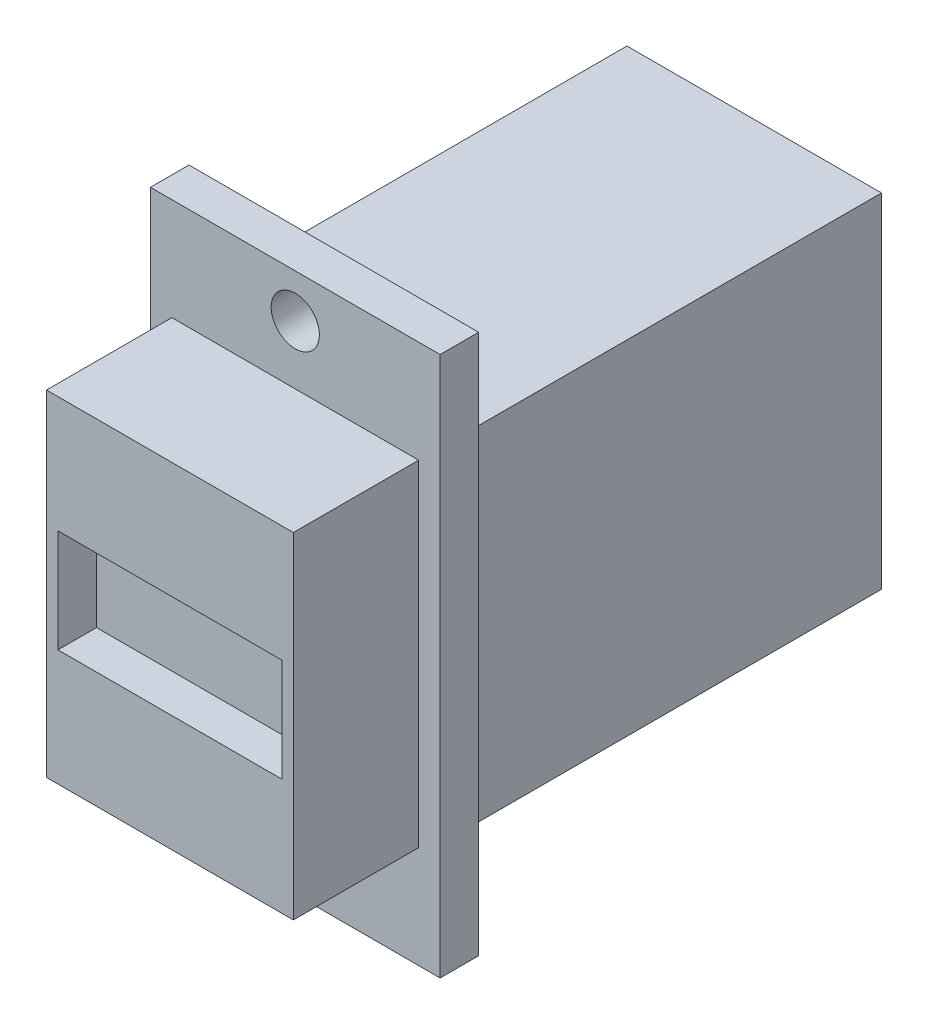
ISO-10303-21;
HEADER;
FILE_DESCRIPTION(('STEP AP214'),'2;1');
FILE_NAME('part.step','',(''),(''),'','','');
FILE_SCHEMA(('AUTOMOTIVE_DESIGN { 1 0 10303 214 1 1 1 1 }'));
ENDSEC;
DATA;
#1=APPLICATION_CONTEXT('core data for automotive mechanical design processes');
#2=APPLICATION_PROTOCOL_DEFINITION('international standard','automotive_design',2000,#1);
#3=PRODUCT_CONTEXT('',#1,'mechanical');
#4=PRODUCT('Part','Part','',(#3));
#5=PRODUCT_RELATED_PRODUCT_CATEGORY('part','',(#4));
#6=PRODUCT_DEFINITION_FORMATION('','',#4);
#7=PRODUCT_DEFINITION_CONTEXT('part definition',#1,'design');
#8=PRODUCT_DEFINITION('design','',#6,#7);
#9=PRODUCT_DEFINITION_SHAPE('','',#8);
#10=(LENGTH_UNIT() NAMED_UNIT(*) SI_UNIT(.MILLI.,.METRE.));
#11=(NAMED_UNIT(*) PLANE_ANGLE_UNIT() SI_UNIT($,.RADIAN.));
#12=(NAMED_UNIT(*) SI_UNIT($,.STERADIAN.) SOLID_ANGLE_UNIT());
#13=UNCERTAINTY_MEASURE_WITH_UNIT(LENGTH_MEASURE(1.E-05),#10,'distance_accuracy_value','');
#14=(GEOMETRIC_REPRESENTATION_CONTEXT(3) GLOBAL_UNCERTAINTY_ASSIGNED_CONTEXT((#13)) GLOBAL_UNIT_ASSIGNED_CONTEXT((#10,
#11,#12)) REPRESENTATION_CONTEXT('',''));
#15=CARTESIAN_POINT('',(0.,0.,0.));
#16=DIRECTION('',(0.,0.,1.));
#17=DIRECTION('',(1.,0.,0.));
#18=AXIS2_PLACEMENT_3D('',#15,#16,#17);
#19=CARTESIAN_POINT('',(0.,0.,0.));
#20=DIRECTION('',(0.,0.,1.));
#21=DIRECTION('',(1.,0.,0.));
#22=AXIS2_PLACEMENT_3D('',#19,#20,#21);
#23=PLANE('',#22);
#24=CARTESIAN_POINT('',(0.,-14.605,0.));
#25=DIRECTION('',(0.,0.,1.));
#26=DIRECTION('',(1.,0.,0.));
#27=AXIS2_PLACEMENT_3D('',#24,#25,#26);
#28=CIRCLE('',#27,1.5875);
#29=CARTESIAN_POINT('',(1.5875,-14.605,0.));
#30=VERTEX_POINT('',#29);
#31=EDGE_CURVE('E286',#30,#30,#28,.T.);
#32=ORIENTED_EDGE('',*,*,#31,.T.);
#33=EDGE_LOOP('',(#32));
#34=FACE_BOUND('',#33,.T.);
#35=CARTESIAN_POINT('',(0.,14.9225,0.));
#36=DIRECTION('',(0.,0.,1.));
#37=DIRECTION('',(1.,0.,0.));
#38=AXIS2_PLACEMENT_3D('',#35,#36,#37);
#39=CIRCLE('',#38,1.5875);
#40=CARTESIAN_POINT('',(1.5875,14.9225,0.));
#41=VERTEX_POINT('',#40);
#42=EDGE_CURVE('E290',#41,#41,#39,.T.);
#43=ORIENTED_EDGE('',*,*,#42,.T.);
#44=EDGE_LOOP('',(#43));
#45=FACE_BOUND('',#44,.T.);
#46=DIRECTION('',(1.,0.,0.));
#47=VECTOR('',#46,1.);
#48=CARTESIAN_POINT('',(-9.53982109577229,17.78,0.));
#49=LINE('',#48,#47);
#50=CARTESIAN_POINT('',(-9.53982109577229,17.78,0.));
#51=VERTEX_POINT('',#50);
#52=CARTESIAN_POINT('',(9.5398210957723,17.78,0.));
#53=VERTEX_POINT('',#52);
#54=EDGE_CURVE('E296',#51,#53,#49,.T.);
#55=ORIENTED_EDGE('',*,*,#54,.T.);
#56=DIRECTION('',(0.,1.,0.));
#57=VECTOR('',#56,1.);
#58=CARTESIAN_POINT('',(9.5398210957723,-17.78,0.));
#59=LINE('',#58,#57);
#60=CARTESIAN_POINT('',(9.5398210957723,-17.78,0.));
#61=VERTEX_POINT('',#60);
#62=EDGE_CURVE('E312',#61,#53,#59,.T.);
#63=ORIENTED_EDGE('',*,*,#62,.F.);
#64=DIRECTION('',(1.,0.,0.));
#65=VECTOR('',#64,1.);
#66=CARTESIAN_POINT('',(-9.53982109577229,-17.78,0.));
#67=LINE('',#66,#65);
#68=CARTESIAN_POINT('',(-9.53982109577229,-17.78,0.));
#69=VERTEX_POINT('',#68);
#70=EDGE_CURVE('E315',#69,#61,#67,.T.);
#71=ORIENTED_EDGE('',*,*,#70,.F.);
#72=DIRECTION('',(0.,1.,0.));
#73=VECTOR('',#72,1.);
#74=CARTESIAN_POINT('',(-9.53982109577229,-17.78,0.));
#75=LINE('',#74,#73);
#76=EDGE_CURVE('E303',#69,#51,#75,.T.);
#77=ORIENTED_EDGE('',*,*,#76,.T.);
#78=EDGE_LOOP('',(#55,#63,#71,#77));
#79=FACE_BOUND('',#78,.T.);
#80=DIRECTION('',(0.,1.,0.));
#81=VECTOR('',#80,1.);
#82=CARTESIAN_POINT('',(-8.382,-11.303,0.));
#83=LINE('',#82,#81);
#84=CARTESIAN_POINT('',(-8.382,-11.303,0.));
#85=VERTEX_POINT('',#84);
#86=CARTESIAN_POINT('',(-8.382,11.303,0.));
#87=VERTEX_POINT('',#86);
#88=EDGE_CURVE('E224',#85,#87,#83,.T.);
#89=ORIENTED_EDGE('',*,*,#88,.F.);
#90=DIRECTION('',(-1.,0.,0.));
#91=VECTOR('',#90,1.);
#92=CARTESIAN_POINT('',(8.382,-11.303,0.));
#93=LINE('',#92,#91);
#94=CARTESIAN_POINT('',(8.382,-11.303,0.));
#95=VERTEX_POINT('',#94);
#96=EDGE_CURVE('E232',#95,#85,#93,.T.);
#97=ORIENTED_EDGE('',*,*,#96,.F.);
#98=DIRECTION('',(0.,-1.,0.));
#99=VECTOR('',#98,1.);
#100=CARTESIAN_POINT('',(8.382,-11.303,0.));
#101=LINE('',#100,#99);
#102=CARTESIAN_POINT('',(8.382,11.303,0.));
#103=VERTEX_POINT('',#102);
#104=EDGE_CURVE('E242',#103,#95,#101,.T.);
#105=ORIENTED_EDGE('',*,*,#104,.F.);
#106=DIRECTION('',(1.,0.,0.));
#107=VECTOR('',#106,1.);
#108=CARTESIAN_POINT('',(8.382,11.303,0.));
#109=LINE('',#108,#107);
#110=EDGE_CURVE('E100',#87,#103,#109,.T.);
#111=ORIENTED_EDGE('',*,*,#110,.F.);
#112=EDGE_LOOP('',(#89,#97,#105,#111));
#113=FACE_BOUND('',#112,.T.);
#114=ADVANCED_FACE('F75',(#34,#45,#79,#113),#23,.F.);
#115=CARTESIAN_POINT('',(0.,0.,2.54));
#116=DIRECTION('',(0.,0.,1.));
#117=DIRECTION('',(1.,0.,0.));
#118=AXIS2_PLACEMENT_3D('',#115,#116,#117);
#119=PLANE('',#118);
#120=CARTESIAN_POINT('',(0.,14.9225,2.54));
#121=DIRECTION('',(0.,0.,1.));
#122=DIRECTION('',(1.,0.,0.));
#123=AXIS2_PLACEMENT_3D('',#120,#121,#122);
#124=CIRCLE('',#123,1.5875);
#125=CARTESIAN_POINT('',(1.5875,14.9225,2.54));
#126=VERTEX_POINT('',#125);
#127=EDGE_CURVE('E293',#126,#126,#124,.T.);
#128=ORIENTED_EDGE('',*,*,#127,.F.);
#129=EDGE_LOOP('',(#128));
#130=FACE_BOUND('',#129,.T.);
#131=DIRECTION('',(1.,0.,0.));
#132=VECTOR('',#131,1.);
#133=CARTESIAN_POINT('',(-9.53982109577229,17.78,2.54));
#134=LINE('',#133,#132);
#135=CARTESIAN_POINT('',(-9.53982109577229,17.78,2.54));
#136=VERTEX_POINT('',#135);
#137=CARTESIAN_POINT('',(9.5398210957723,17.78,2.54));
#138=VERTEX_POINT('',#137);
#139=EDGE_CURVE('E299',#136,#138,#134,.T.);
#140=ORIENTED_EDGE('',*,*,#139,.F.);
#141=DIRECTION('',(0.,1.,0.));
#142=VECTOR('',#141,1.);
#143=CARTESIAN_POINT('',(-9.53982109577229,-17.78,2.54));
#144=LINE('',#143,#142);
#145=CARTESIAN_POINT('',(-9.53982109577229,-17.78,2.54));
#146=VERTEX_POINT('',#145);
#147=EDGE_CURVE('E307',#146,#136,#144,.T.);
#148=ORIENTED_EDGE('',*,*,#147,.F.);
#149=DIRECTION('',(1.,0.,0.));
#150=VECTOR('',#149,1.);
#151=CARTESIAN_POINT('',(-9.53982109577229,-17.78,2.54));
#152=LINE('',#151,#150);
#153=CARTESIAN_POINT('',(9.5398210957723,-17.78,2.54));
#154=VERTEX_POINT('',#153);
#155=EDGE_CURVE('E305',#146,#154,#152,.T.);
#156=ORIENTED_EDGE('',*,*,#155,.T.);
#157=DIRECTION('',(0.,1.,0.));
#158=VECTOR('',#157,1.);
#159=CARTESIAN_POINT('',(9.5398210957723,-17.78,2.54));
#160=LINE('',#159,#158);
#161=EDGE_CURVE('E302',#154,#138,#160,.T.);
#162=ORIENTED_EDGE('',*,*,#161,.T.);
#163=EDGE_LOOP('',(#140,#148,#156,#162));
#164=FACE_BOUND('',#163,.T.);
#165=CARTESIAN_POINT('',(0.,-14.605,2.54));
#166=DIRECTION('',(0.,0.,1.));
#167=DIRECTION('',(1.,0.,0.));
#168=AXIS2_PLACEMENT_3D('',#165,#166,#167);
#169=CIRCLE('',#168,1.5875);
#170=CARTESIAN_POINT('',(1.5875,-14.605,2.54));
#171=VERTEX_POINT('',#170);
#172=EDGE_CURVE('E287',#171,#171,#169,.T.);
#173=ORIENTED_EDGE('',*,*,#172,.F.);
#174=EDGE_LOOP('',(#173));
#175=FACE_BOUND('',#174,.T.);
#176=DIRECTION('',(-1.,0.,0.));
#177=VECTOR('',#176,1.);
#178=CARTESIAN_POINT('',(-8.128,11.049,2.54));
#179=LINE('',#178,#177);
#180=CARTESIAN_POINT('',(8.128,11.049,2.54));
#181=VERTEX_POINT('',#180);
#182=CARTESIAN_POINT('',(-8.128,11.049,2.54));
#183=VERTEX_POINT('',#182);
#184=EDGE_CURVE('E271',#181,#183,#179,.T.);
#185=ORIENTED_EDGE('',*,*,#184,.F.);
#186=DIRECTION('',(0.,1.,0.));
#187=VECTOR('',#186,1.);
#188=CARTESIAN_POINT('',(8.128,-11.049,2.54));
#189=LINE('',#188,#187);
#190=CARTESIAN_POINT('',(8.128,-11.049,2.54));
#191=VERTEX_POINT('',#190);
#192=EDGE_CURVE('E257',#191,#181,#189,.T.);
#193=ORIENTED_EDGE('',*,*,#192,.F.);
#194=DIRECTION('',(1.,0.,0.));
#195=VECTOR('',#194,1.);
#196=CARTESIAN_POINT('',(-8.128,-11.049,2.54));
#197=LINE('',#196,#195);
#198=CARTESIAN_POINT('',(-8.128,-11.049,2.54));
#199=VERTEX_POINT('',#198);
#200=EDGE_CURVE('E262',#199,#191,#197,.T.);
#201=ORIENTED_EDGE('',*,*,#200,.F.);
#202=DIRECTION('',(0.,-1.,0.));
#203=VECTOR('',#202,1.);
#204=CARTESIAN_POINT('',(-8.128,-11.049,2.54));
#205=LINE('',#204,#203);
#206=EDGE_CURVE('E273',#183,#199,#205,.T.);
#207=ORIENTED_EDGE('',*,*,#206,.F.);
#208=EDGE_LOOP('',(#185,#193,#201,#207));
#209=FACE_BOUND('',#208,.T.);
#210=ADVANCED_FACE('F338',(#130,#164,#175,#209),#119,.T.);
#211=CARTESIAN_POINT('',(-9.53982109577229,17.78,2.54));
#212=DIRECTION('',(0.,1.,0.));
#213=DIRECTION('',(0.,0.,1.));
#214=AXIS2_PLACEMENT_3D('',#211,#212,#213);
#215=PLANE('',#214);
#216=ORIENTED_EDGE('',*,*,#54,.F.);
#217=DIRECTION('',(0.,0.,-1.));
#218=VECTOR('',#217,1.);
#219=CARTESIAN_POINT('',(-9.53982109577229,17.78,2.54));
#220=LINE('',#219,#218);
#221=EDGE_CURVE('E12',#136,#51,#220,.T.);
#222=ORIENTED_EDGE('',*,*,#221,.F.);
#223=ORIENTED_EDGE('',*,*,#139,.T.);
#224=DIRECTION('',(0.,0.,-1.));
#225=VECTOR('',#224,1.);
#226=CARTESIAN_POINT('',(9.5398210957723,17.78,2.54));
#227=LINE('',#226,#225);
#228=EDGE_CURVE('E79',#138,#53,#227,.T.);
#229=ORIENTED_EDGE('',*,*,#228,.T.);
#230=EDGE_LOOP('',(#216,#222,#223,#229));
#231=FACE_BOUND('',#230,.T.);
#232=ADVANCED_FACE('F77',(#231),#215,.T.);
#233=CARTESIAN_POINT('',(-9.53982109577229,-17.78,2.54));
#234=DIRECTION('',(-1.,0.,0.));
#235=DIRECTION('',(0.,0.,1.));
#236=AXIS2_PLACEMENT_3D('',#233,#234,#235);
#237=PLANE('',#236);
#238=ORIENTED_EDGE('',*,*,#76,.F.);
#239=DIRECTION('',(0.,0.,-1.));
#240=VECTOR('',#239,1.);
#241=CARTESIAN_POINT('',(-9.53982109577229,-17.78,2.54));
#242=LINE('',#241,#240);
#243=EDGE_CURVE('E84',#146,#69,#242,.T.);
#244=ORIENTED_EDGE('',*,*,#243,.F.);
#245=ORIENTED_EDGE('',*,*,#147,.T.);
#246=ORIENTED_EDGE('',*,*,#221,.T.);
#247=EDGE_LOOP('',(#238,#244,#245,#246));
#248=FACE_BOUND('',#247,.T.);
#249=ADVANCED_FACE('F334',(#248),#237,.T.);
#250=CARTESIAN_POINT('',(-9.53982109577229,-17.78,2.54));
#251=DIRECTION('',(0.,1.,0.));
#252=DIRECTION('',(0.,0.,1.));
#253=AXIS2_PLACEMENT_3D('',#250,#251,#252);
#254=PLANE('',#253);
#255=ORIENTED_EDGE('',*,*,#70,.T.);
#256=DIRECTION('',(0.,0.,-1.));
#257=VECTOR('',#256,1.);
#258=CARTESIAN_POINT('',(9.5398210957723,-17.78,2.54));
#259=LINE('',#258,#257);
#260=EDGE_CURVE('E319',#154,#61,#259,.T.);
#261=ORIENTED_EDGE('',*,*,#260,.F.);
#262=ORIENTED_EDGE('',*,*,#155,.F.);
#263=ORIENTED_EDGE('',*,*,#243,.T.);
#264=EDGE_LOOP('',(#255,#261,#262,#263));
#265=FACE_BOUND('',#264,.T.);
#266=ADVANCED_FACE('F341',(#265),#254,.F.);
#267=CARTESIAN_POINT('',(9.5398210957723,-17.78,2.54));
#268=DIRECTION('',(-1.,0.,0.));
#269=DIRECTION('',(0.,0.,1.));
#270=AXIS2_PLACEMENT_3D('',#267,#268,#269);
#271=PLANE('',#270);
#272=ORIENTED_EDGE('',*,*,#62,.T.);
#273=ORIENTED_EDGE('',*,*,#228,.F.);
#274=ORIENTED_EDGE('',*,*,#161,.F.);
#275=ORIENTED_EDGE('',*,*,#260,.T.);
#276=EDGE_LOOP('',(#272,#273,#274,#275));
#277=FACE_BOUND('',#276,.T.);
#278=ADVANCED_FACE('F329',(#277),#271,.F.);
#279=CARTESIAN_POINT('',(0.,14.9225,2.54));
#280=DIRECTION('',(0.,0.,-1.));
#281=DIRECTION('',(-1.,0.,0.));
#282=AXIS2_PLACEMENT_3D('',#279,#280,#281);
#283=CYLINDRICAL_SURFACE('',#282,1.5875);
#284=ORIENTED_EDGE('',*,*,#127,.T.);
#285=EDGE_LOOP('',(#284));
#286=FACE_BOUND('',#285,.T.);
#287=ORIENTED_EDGE('',*,*,#42,.F.);
#288=EDGE_LOOP('',(#287));
#289=FACE_BOUND('',#288,.T.);
#290=ADVANCED_FACE('F348',(#286,#289),#283,.F.);
#291=CARTESIAN_POINT('',(0.,-14.605,2.54));
#292=DIRECTION('',(0.,0.,-1.));
#293=DIRECTION('',(-1.,0.,0.));
#294=AXIS2_PLACEMENT_3D('',#291,#292,#293);
#295=CYLINDRICAL_SURFACE('',#294,1.5875);
#296=ORIENTED_EDGE('',*,*,#172,.T.);
#297=EDGE_LOOP('',(#296));
#298=FACE_BOUND('',#297,.T.);
#299=ORIENTED_EDGE('',*,*,#31,.F.);
#300=EDGE_LOOP('',(#299));
#301=FACE_BOUND('',#300,.T.);
#302=ADVANCED_FACE('F364',(#298,#301),#295,.F.);
#303=CARTESIAN_POINT('',(8.128,-11.049,10.795));
#304=DIRECTION('',(-1.,0.,0.));
#305=DIRECTION('',(0.,0.,1.));
#306=AXIS2_PLACEMENT_3D('',#303,#304,#305);
#307=PLANE('',#306);
#308=ORIENTED_EDGE('',*,*,#192,.T.);
#309=DIRECTION('',(0.,0.,-1.));
#310=VECTOR('',#309,1.);
#311=CARTESIAN_POINT('',(8.128,11.049,10.795));
#312=LINE('',#311,#310);
#313=CARTESIAN_POINT('',(8.128,11.049,10.795));
#314=VERTEX_POINT('',#313);
#315=EDGE_CURVE('E284',#314,#181,#312,.T.);
#316=ORIENTED_EDGE('',*,*,#315,.F.);
#317=DIRECTION('',(0.,1.,0.));
#318=VECTOR('',#317,1.);
#319=CARTESIAN_POINT('',(8.128,-11.049,10.795));
#320=LINE('',#319,#318);
#321=CARTESIAN_POINT('',(8.128,-11.049,10.795));
#322=VERTEX_POINT('',#321);
#323=EDGE_CURVE('E258',#322,#314,#320,.T.);
#324=ORIENTED_EDGE('',*,*,#323,.F.);
#325=DIRECTION('',(0.,0.,-1.));
#326=VECTOR('',#325,1.);
#327=CARTESIAN_POINT('',(8.128,-11.049,10.795));
#328=LINE('',#327,#326);
#329=EDGE_CURVE('E268',#322,#191,#328,.T.);
#330=ORIENTED_EDGE('',*,*,#329,.T.);
#331=EDGE_LOOP('',(#308,#316,#324,#330));
#332=FACE_BOUND('',#331,.T.);
#333=ADVANCED_FACE('F368',(#332),#307,.F.);
#334=CARTESIAN_POINT('',(-8.128,11.049,10.795));
#335=DIRECTION('',(0.,-1.,0.));
#336=DIRECTION('',(0.,0.,-1.));
#337=AXIS2_PLACEMENT_3D('',#334,#335,#336);
#338=PLANE('',#337);
#339=ORIENTED_EDGE('',*,*,#184,.T.);
#340=DIRECTION('',(0.,0.,-1.));
#341=VECTOR('',#340,1.);
#342=CARTESIAN_POINT('',(-8.128,11.049,10.795));
#343=LINE('',#342,#341);
#344=CARTESIAN_POINT('',(-8.128,11.049,10.795));
#345=VERTEX_POINT('',#344);
#346=EDGE_CURVE('E281',#345,#183,#343,.T.);
#347=ORIENTED_EDGE('',*,*,#346,.F.);
#348=DIRECTION('',(-1.,0.,0.));
#349=VECTOR('',#348,1.);
#350=CARTESIAN_POINT('',(-8.128,11.049,10.795));
#351=LINE('',#350,#349);
#352=EDGE_CURVE('E261',#314,#345,#351,.T.);
#353=ORIENTED_EDGE('',*,*,#352,.F.);
#354=ORIENTED_EDGE('',*,*,#315,.T.);
#355=EDGE_LOOP('',(#339,#347,#353,#354));
#356=FACE_BOUND('',#355,.T.);
#357=ADVANCED_FACE('F372',(#356),#338,.F.);
#358=CARTESIAN_POINT('',(-8.128,-11.049,10.795));
#359=DIRECTION('',(1.,0.,0.));
#360=DIRECTION('',(0.,0.,-1.));
#361=AXIS2_PLACEMENT_3D('',#358,#359,#360);
#362=PLANE('',#361);
#363=ORIENTED_EDGE('',*,*,#206,.T.);
#364=DIRECTION('',(0.,0.,-1.));
#365=VECTOR('',#364,1.);
#366=CARTESIAN_POINT('',(-8.128,-11.049,10.795));
#367=LINE('',#366,#365);
#368=CARTESIAN_POINT('',(-8.128,-11.049,10.795));
#369=VERTEX_POINT('',#368);
#370=EDGE_CURVE('E279',#369,#199,#367,.T.);
#371=ORIENTED_EDGE('',*,*,#370,.F.);
#372=DIRECTION('',(0.,-1.,0.));
#373=VECTOR('',#372,1.);
#374=CARTESIAN_POINT('',(-8.128,-11.049,10.795));
#375=LINE('',#374,#373);
#376=EDGE_CURVE('E264',#345,#369,#375,.T.);
#377=ORIENTED_EDGE('',*,*,#376,.F.);
#378=ORIENTED_EDGE('',*,*,#346,.T.);
#379=EDGE_LOOP('',(#363,#371,#377,#378));
#380=FACE_BOUND('',#379,.T.);
#381=ADVANCED_FACE('F376',(#380),#362,.F.);
#382=CARTESIAN_POINT('',(-8.128,-11.049,10.795));
#383=DIRECTION('',(0.,1.,0.));
#384=DIRECTION('',(0.,0.,1.));
#385=AXIS2_PLACEMENT_3D('',#382,#383,#384);
#386=PLANE('',#385);
#387=ORIENTED_EDGE('',*,*,#200,.T.);
#388=ORIENTED_EDGE('',*,*,#329,.F.);
#389=DIRECTION('',(1.,0.,0.));
#390=VECTOR('',#389,1.);
#391=CARTESIAN_POINT('',(-8.128,-11.049,10.795));
#392=LINE('',#391,#390);
#393=EDGE_CURVE('E266',#369,#322,#392,.T.);
#394=ORIENTED_EDGE('',*,*,#393,.F.);
#395=ORIENTED_EDGE('',*,*,#370,.T.);
#396=EDGE_LOOP('',(#387,#388,#394,#395));
#397=FACE_BOUND('',#396,.T.);
#398=ADVANCED_FACE('F380',(#397),#386,.F.);
#399=CARTESIAN_POINT('',(0.,0.,10.795));
#400=DIRECTION('',(0.,0.,-1.));
#401=DIRECTION('',(-1.,0.,0.));
#402=AXIS2_PLACEMENT_3D('',#399,#400,#401);
#403=PLANE('',#402);
#404=DIRECTION('',(-1.,0.,0.));
#405=VECTOR('',#404,1.);
#406=CARTESIAN_POINT('',(-7.37407015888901,3.39374819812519,10.795));
#407=LINE('',#406,#405);
#408=CARTESIAN_POINT('',(7.37407015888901,3.39374819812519,10.795));
#409=VERTEX_POINT('',#408);
#410=CARTESIAN_POINT('',(-7.37407015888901,3.39374819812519,10.795));
#411=VERTEX_POINT('',#410);
#412=EDGE_CURVE('E218',#409,#411,#407,.T.);
#413=ORIENTED_EDGE('',*,*,#412,.F.);
#414=DIRECTION('',(0.,1.,0.));
#415=VECTOR('',#414,1.);
#416=CARTESIAN_POINT('',(7.37407015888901,-3.39374819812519,10.795));
#417=LINE('',#416,#415);
#418=CARTESIAN_POINT('',(7.37407015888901,-3.39374819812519,10.795));
#419=VERTEX_POINT('',#418);
#420=EDGE_CURVE('E92',#419,#409,#417,.T.);
#421=ORIENTED_EDGE('',*,*,#420,.F.);
#422=DIRECTION('',(1.,0.,0.));
#423=VECTOR('',#422,1.);
#424=CARTESIAN_POINT('',(-7.37407015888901,-3.39374819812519,10.795));
#425=LINE('',#424,#423);
#426=CARTESIAN_POINT('',(-7.37407015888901,-3.39374819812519,10.795));
#427=VERTEX_POINT('',#426);
#428=EDGE_CURVE('E209',#427,#419,#425,.T.);
#429=ORIENTED_EDGE('',*,*,#428,.F.);
#430=DIRECTION('',(0.,-1.,0.));
#431=VECTOR('',#430,1.);
#432=CARTESIAN_POINT('',(-7.37407015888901,-3.39374819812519,10.795));
#433=LINE('',#432,#431);
#434=EDGE_CURVE('E212',#411,#427,#433,.T.);
#435=ORIENTED_EDGE('',*,*,#434,.F.);
#436=EDGE_LOOP('',(#413,#421,#429,#435));
#437=FACE_BOUND('',#436,.T.);
#438=ORIENTED_EDGE('',*,*,#323,.T.);
#439=ORIENTED_EDGE('',*,*,#352,.T.);
#440=ORIENTED_EDGE('',*,*,#376,.T.);
#441=ORIENTED_EDGE('',*,*,#393,.T.);
#442=EDGE_LOOP('',(#438,#439,#440,#441));
#443=FACE_BOUND('',#442,.T.);
#444=ADVANCED_FACE('F383',(#437,#443),#403,.F.);
#445=CARTESIAN_POINT('',(-8.382,-11.303,-27.686));
#446=DIRECTION('',(1.,0.,0.));
#447=DIRECTION('',(0.,0.,-1.));
#448=AXIS2_PLACEMENT_3D('',#445,#446,#447);
#449=PLANE('',#448);
#450=ORIENTED_EDGE('',*,*,#88,.T.);
#451=DIRECTION('',(0.,0.,1.));
#452=VECTOR('',#451,1.);
#453=CARTESIAN_POINT('',(-8.382,11.303,-27.686));
#454=LINE('',#453,#452);
#455=CARTESIAN_POINT('',(-8.382,11.303,-27.686));
#456=VERTEX_POINT('',#455);
#457=EDGE_CURVE('E255',#456,#87,#454,.T.);
#458=ORIENTED_EDGE('',*,*,#457,.F.);
#459=DIRECTION('',(0.,1.,0.));
#460=VECTOR('',#459,1.);
#461=CARTESIAN_POINT('',(-8.382,-11.303,-27.686));
#462=LINE('',#461,#460);
#463=CARTESIAN_POINT('',(-8.382,-11.303,-27.686));
#464=VERTEX_POINT('',#463);
#465=EDGE_CURVE('E228',#464,#456,#462,.T.);
#466=ORIENTED_EDGE('',*,*,#465,.F.);
#467=DIRECTION('',(0.,0.,1.));
#468=VECTOR('',#467,1.);
#469=CARTESIAN_POINT('',(-8.382,-11.303,-27.686));
#470=LINE('',#469,#468);
#471=EDGE_CURVE('E238',#464,#85,#470,.T.);
#472=ORIENTED_EDGE('',*,*,#471,.T.);
#473=EDGE_LOOP('',(#450,#458,#466,#472));
#474=FACE_BOUND('',#473,.T.);
#475=ADVANCED_FACE('F387',(#474),#449,.F.);
#476=CARTESIAN_POINT('',(8.382,11.303,-27.686));
#477=DIRECTION('',(0.,-1.,0.));
#478=DIRECTION('',(0.,0.,-1.));
#479=AXIS2_PLACEMENT_3D('',#476,#477,#478);
#480=PLANE('',#479);
#481=ORIENTED_EDGE('',*,*,#110,.T.);
#482=DIRECTION('',(0.,0.,1.));
#483=VECTOR('',#482,1.);
#484=CARTESIAN_POINT('',(8.382,11.303,-27.686));
#485=LINE('',#484,#483);
#486=CARTESIAN_POINT('',(8.382,11.303,-27.686));
#487=VERTEX_POINT('',#486);
#488=EDGE_CURVE('E252',#487,#103,#485,.T.);
#489=ORIENTED_EDGE('',*,*,#488,.F.);
#490=DIRECTION('',(1.,0.,0.));
#491=VECTOR('',#490,1.);
#492=CARTESIAN_POINT('',(8.382,11.303,-27.686));
#493=LINE('',#492,#491);
#494=EDGE_CURVE('E231',#456,#487,#493,.T.);
#495=ORIENTED_EDGE('',*,*,#494,.F.);
#496=ORIENTED_EDGE('',*,*,#457,.T.);
#497=EDGE_LOOP('',(#481,#489,#495,#496));
#498=FACE_BOUND('',#497,.T.);
#499=ADVANCED_FACE('F390',(#498),#480,.F.);
#500=CARTESIAN_POINT('',(8.382,-11.303,-27.686));
#501=DIRECTION('',(-1.,0.,0.));
#502=DIRECTION('',(0.,0.,1.));
#503=AXIS2_PLACEMENT_3D('',#500,#501,#502);
#504=PLANE('',#503);
#505=ORIENTED_EDGE('',*,*,#104,.T.);
#506=DIRECTION('',(0.,0.,1.));
#507=VECTOR('',#506,1.);
#508=CARTESIAN_POINT('',(8.382,-11.303,-27.686));
#509=LINE('',#508,#507);
#510=CARTESIAN_POINT('',(8.382,-11.303,-27.686));
#511=VERTEX_POINT('',#510);
#512=EDGE_CURVE('E249',#511,#95,#509,.T.);
#513=ORIENTED_EDGE('',*,*,#512,.F.);
#514=DIRECTION('',(0.,-1.,0.));
#515=VECTOR('',#514,1.);
#516=CARTESIAN_POINT('',(8.382,-11.303,-27.686));
#517=LINE('',#516,#515);
#518=EDGE_CURVE('E234',#487,#511,#517,.T.);
#519=ORIENTED_EDGE('',*,*,#518,.F.);
#520=ORIENTED_EDGE('',*,*,#488,.T.);
#521=EDGE_LOOP('',(#505,#513,#519,#520));
#522=FACE_BOUND('',#521,.T.);
#523=ADVANCED_FACE('F394',(#522),#504,.F.);
#524=CARTESIAN_POINT('',(8.382,-11.303,-27.686));
#525=DIRECTION('',(0.,1.,0.));
#526=DIRECTION('',(0.,0.,1.));
#527=AXIS2_PLACEMENT_3D('',#524,#525,#526);
#528=PLANE('',#527);
#529=ORIENTED_EDGE('',*,*,#96,.T.);
#530=ORIENTED_EDGE('',*,*,#471,.F.);
#531=DIRECTION('',(-1.,0.,0.));
#532=VECTOR('',#531,1.);
#533=CARTESIAN_POINT('',(8.382,-11.303,-27.686));
#534=LINE('',#533,#532);
#535=EDGE_CURVE('E236',#511,#464,#534,.T.);
#536=ORIENTED_EDGE('',*,*,#535,.F.);
#537=ORIENTED_EDGE('',*,*,#512,.T.);
#538=EDGE_LOOP('',(#529,#530,#536,#537));
#539=FACE_BOUND('',#538,.T.);
#540=ADVANCED_FACE('F398',(#539),#528,.F.);
#541=CARTESIAN_POINT('',(0.,0.,-27.686));
#542=DIRECTION('',(0.,0.,1.));
#543=DIRECTION('',(1.,0.,0.));
#544=AXIS2_PLACEMENT_3D('',#541,#542,#543);
#545=PLANE('',#544);
#546=ORIENTED_EDGE('',*,*,#465,.T.);
#547=ORIENTED_EDGE('',*,*,#494,.T.);
#548=ORIENTED_EDGE('',*,*,#518,.T.);
#549=ORIENTED_EDGE('',*,*,#535,.T.);
#550=EDGE_LOOP('',(#546,#547,#548,#549));
#551=FACE_BOUND('',#550,.T.);
#552=ADVANCED_FACE('F402',(#551),#545,.F.);
#553=CARTESIAN_POINT('',(7.37407015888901,-3.39374819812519,8.255));
#554=DIRECTION('',(1.,0.,0.));
#555=DIRECTION('',(0.,0.,-1.));
#556=AXIS2_PLACEMENT_3D('',#553,#554,#555);
#557=PLANE('',#556);
#558=ORIENTED_EDGE('',*,*,#420,.T.);
#559=DIRECTION('',(0.,0.,1.));
#560=VECTOR('',#559,1.);
#561=CARTESIAN_POINT('',(7.37407015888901,3.39374819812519,8.255));
#562=LINE('',#561,#560);
#563=CARTESIAN_POINT('',(7.37407015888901,3.39374819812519,8.255));
#564=VERTEX_POINT('',#563);
#565=EDGE_CURVE('E187',#564,#409,#562,.T.);
#566=ORIENTED_EDGE('',*,*,#565,.F.);
#567=DIRECTION('',(0.,1.,0.));
#568=VECTOR('',#567,1.);
#569=CARTESIAN_POINT('',(7.37407015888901,-3.39374819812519,8.255));
#570=LINE('',#569,#568);
#571=CARTESIAN_POINT('',(7.37407015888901,-3.39374819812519,8.255));
#572=VERTEX_POINT('',#571);
#573=EDGE_CURVE('E191',#572,#564,#570,.T.);
#574=ORIENTED_EDGE('',*,*,#573,.F.);
#575=DIRECTION('',(0.,0.,1.));
#576=VECTOR('',#575,1.);
#577=CARTESIAN_POINT('',(7.37407015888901,-3.39374819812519,8.255));
#578=LINE('',#577,#576);
#579=EDGE_CURVE('E222',#572,#419,#578,.T.);
#580=ORIENTED_EDGE('',*,*,#579,.T.);
#581=EDGE_LOOP('',(#558,#566,#574,#580));
#582=FACE_BOUND('',#581,.T.);
#583=ADVANCED_FACE('F189',(#582),#557,.F.);
#584=CARTESIAN_POINT('',(-7.37407015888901,-3.39374819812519,8.255));
#585=DIRECTION('',(0.,-1.,0.));
#586=DIRECTION('',(0.,0.,-1.));
#587=AXIS2_PLACEMENT_3D('',#584,#585,#586);
#588=PLANE('',#587);
#589=ORIENTED_EDGE('',*,*,#428,.T.);
#590=ORIENTED_EDGE('',*,*,#579,.F.);
#591=DIRECTION('',(1.,0.,0.));
#592=VECTOR('',#591,1.);
#593=CARTESIAN_POINT('',(-7.37407015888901,-3.39374819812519,8.255));
#594=LINE('',#593,#592);
#595=CARTESIAN_POINT('',(-7.37407015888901,-3.39374819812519,8.255));
#596=VERTEX_POINT('',#595);
#597=EDGE_CURVE('E197',#596,#572,#594,.T.);
#598=ORIENTED_EDGE('',*,*,#597,.F.);
#599=DIRECTION('',(0.,0.,1.));
#600=VECTOR('',#599,1.);
#601=CARTESIAN_POINT('',(-7.37407015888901,-3.39374819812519,8.255));
#602=LINE('',#601,#600);
#603=EDGE_CURVE('E225',#596,#427,#602,.T.);
#604=ORIENTED_EDGE('',*,*,#603,.T.);
#605=EDGE_LOOP('',(#589,#590,#598,#604));
#606=FACE_BOUND('',#605,.T.);
#607=ADVANCED_FACE('F409',(#606),#588,.F.);
#608=CARTESIAN_POINT('',(-7.37407015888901,-3.39374819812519,8.255));
#609=DIRECTION('',(-1.,0.,0.));
#610=DIRECTION('',(0.,0.,1.));
#611=AXIS2_PLACEMENT_3D('',#608,#609,#610);
#612=PLANE('',#611);
#613=ORIENTED_EDGE('',*,*,#434,.T.);
#614=ORIENTED_EDGE('',*,*,#603,.F.);
#615=DIRECTION('',(0.,-1.,0.));
#616=VECTOR('',#615,1.);
#617=CARTESIAN_POINT('',(-7.37407015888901,-3.39374819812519,8.255));
#618=LINE('',#617,#616);
#619=CARTESIAN_POINT('',(-7.37407015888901,3.39374819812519,8.255));
#620=VERTEX_POINT('',#619);
#621=EDGE_CURVE('E205',#620,#596,#618,.T.);
#622=ORIENTED_EDGE('',*,*,#621,.F.);
#623=DIRECTION('',(0.,0.,1.));
#624=VECTOR('',#623,1.);
#625=CARTESIAN_POINT('',(-7.37407015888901,3.39374819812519,8.255));
#626=LINE('',#625,#624);
#627=EDGE_CURVE('E196',#620,#411,#626,.T.);
#628=ORIENTED_EDGE('',*,*,#627,.T.);
#629=EDGE_LOOP('',(#613,#614,#622,#628));
#630=FACE_BOUND('',#629,.T.);
#631=ADVANCED_FACE('F412',(#630),#612,.F.);
#632=CARTESIAN_POINT('',(-7.37407015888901,3.39374819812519,8.255));
#633=DIRECTION('',(0.,1.,0.));
#634=DIRECTION('',(0.,0.,1.));
#635=AXIS2_PLACEMENT_3D('',#632,#633,#634);
#636=PLANE('',#635);
#637=ORIENTED_EDGE('',*,*,#412,.T.);
#638=ORIENTED_EDGE('',*,*,#627,.F.);
#639=DIRECTION('',(-1.,0.,0.));
#640=VECTOR('',#639,1.);
#641=CARTESIAN_POINT('',(-7.37407015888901,3.39374819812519,8.255));
#642=LINE('',#641,#640);
#643=EDGE_CURVE('E200',#564,#620,#642,.T.);
#644=ORIENTED_EDGE('',*,*,#643,.F.);
#645=ORIENTED_EDGE('',*,*,#565,.T.);
#646=EDGE_LOOP('',(#637,#638,#644,#645));
#647=FACE_BOUND('',#646,.T.);
#648=ADVANCED_FACE('F201',(#647),#636,.F.);
#649=CARTESIAN_POINT('',(0.,0.,8.255));
#650=DIRECTION('',(0.,0.,-1.));
#651=DIRECTION('',(-1.,0.,0.));
#652=AXIS2_PLACEMENT_3D('',#649,#650,#651);
#653=PLANE('',#652);
#654=ORIENTED_EDGE('',*,*,#573,.T.);
#655=ORIENTED_EDGE('',*,*,#643,.T.);
#656=ORIENTED_EDGE('',*,*,#621,.T.);
#657=ORIENTED_EDGE('',*,*,#597,.T.);
#658=EDGE_LOOP('',(#654,#655,#656,#657));
#659=FACE_BOUND('',#658,.T.);
#660=ADVANCED_FACE('F207',(#659),#653,.F.);
#661=CLOSED_SHELL('',(#114,#210,#232,#249,#266,#278,#290,#302,#333,#357,#381,#398,#444,#475,
#499,#523,#540,#552,#583,#607,#631,#648,#660));
#662=MANIFOLD_SOLID_BREP('B2',#661);
#663=ADVANCED_BREP_SHAPE_REPRESENTATION('',(#18,#662),#14);
#664=SHAPE_DEFINITION_REPRESENTATION(#9,#663);
ENDSEC;
END-ISO-10303-21;
